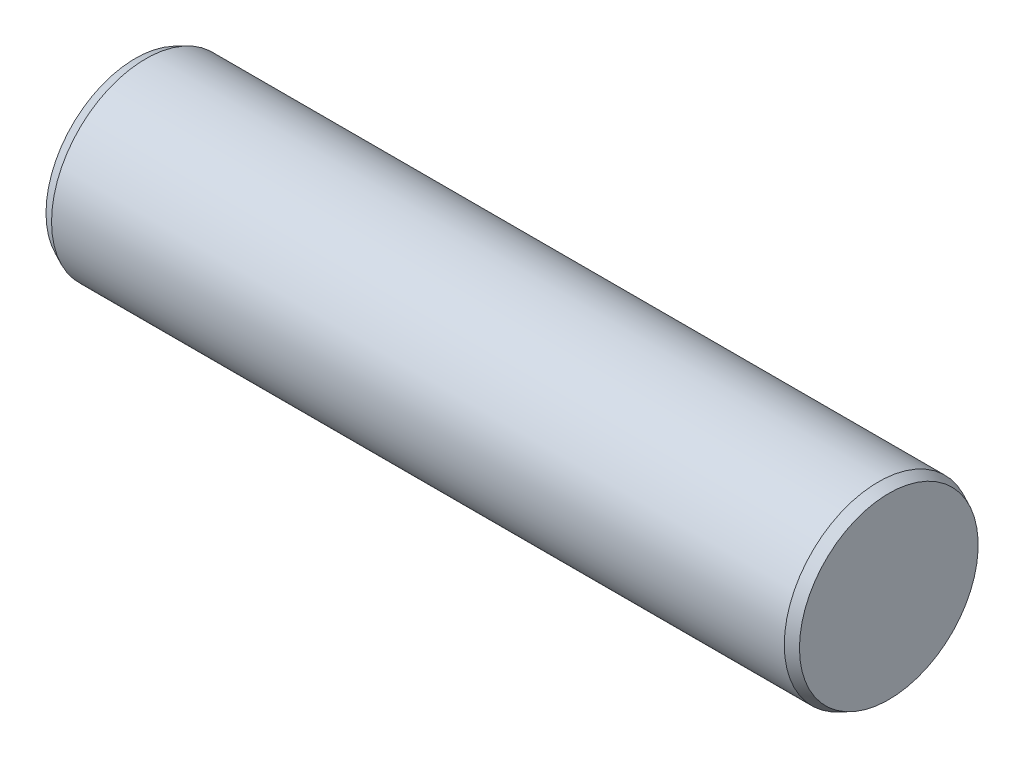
from build123d import *


with BuildPart() as part:
    # Sketch1 → Base-Revolve (revolve)
    with BuildSketch(Plane.XY, mode=Mode.PRIVATE) as base_revolve_sk:
        Polygon((0, 0), (101.6, 0), (101.6, 12.048568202), (100.203, 12.7), (1.397, 12.7), (0, 12.048568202), align=None)
    revolve(base_revolve_sk.sketch.rotate(Axis((-6.35, 0, 0), (1, 0, 0)), 90), axis=Axis((-6.35, 0, 0), (1, 0, 0)))


solid = part.part
